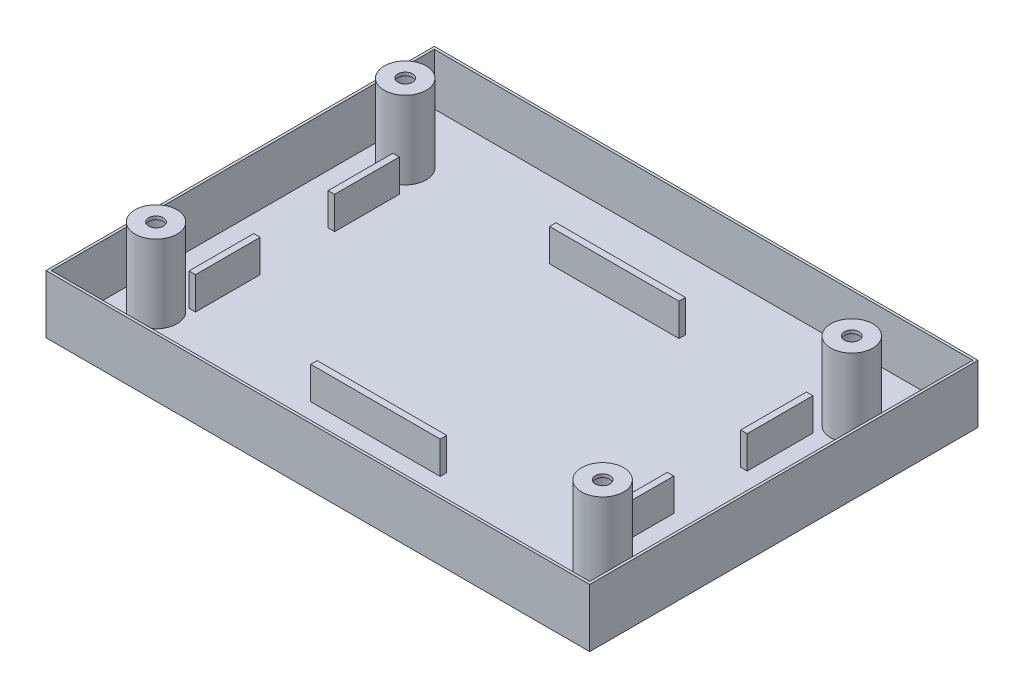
from build123d import *

# Parameters (mm, degrees)
SKETCH4_W             = 84
SKETCH4_H             = 60
BOSS_EXTRUDE2_DEPTH   = 9
SKETCH5_W             = 83.2
SKETCH5_H             = 59.2
CUT_EXTRUDE2_DEPTH    = 8
SKETCH9_W             = 1
SKETCH9_H             = 10
SKETCH9_H_2           = 10.159774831
SKETCH9_W_2           = 20
SKETCH9_H_3           = 1
BOSS_EXTRUDE4_DEPTH   = 5
SKETCH10_R            = 3.25
BOSS_EXTRUDE5_DEPTH   = 13
SKETCH11_R            = 2.9
CUT_EXTRUDE3_DEPTH    = 12.5
F_4_40_TAPPED_HOLE2_D = 2.2606
F_4_40_TAPPED_HOLE3_D = 2.2606


with BuildPart() as part:
    # Sketch4 → Boss-Extrude2 (new body)
    with BuildSketch(Plane(origin=(0, 0, 0), x_dir=(1, 0, 0), z_dir=(0, 1, 0))):
        with Locations((42, 30)):
            Rectangle(SKETCH4_W, SKETCH4_H)
    extrude(amount=BOSS_EXTRUDE2_DEPTH)

    # Sketch5 → Cut-Extrude2 (cut)
    with BuildSketch(Plane(origin=(0, 9, 0), x_dir=(1, 0, 0), z_dir=(0, 1, 0))):
        with Locations((42, 30)):
            Rectangle(SKETCH5_W, SKETCH5_H)
    extrude(amount=-CUT_EXTRUDE2_DEPTH, mode=Mode.SUBTRACT)

    # Sketch9 → Boss-Extrude4 (add)
    with BuildSketch(Plane(origin=(0, 1, 0), x_dir=(1, 0, 0), z_dir=(0, 1, 0))):
        with Locations((8.6, 40.5)):
            Rectangle(SKETCH9_W, SKETCH9_H)
        with Locations((8.6, 19)):
            Rectangle(SKETCH9_W, SKETCH9_H)
        with Locations((72.5, 40.420112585)):
            Rectangle(SKETCH9_W, SKETCH9_H_2)
        with Locations((72.5, 19)):
            Rectangle(SKETCH9_W, SKETCH9_H)
        with Locations((40, 48.3)):
            Rectangle(SKETCH9_W_2, SKETCH9_H_3)
        with Locations((40, 11.4)):
            Rectangle(SKETCH9_W_2, SKETCH9_H_3)
    extrude(amount=BOSS_EXTRUDE4_DEPTH)

    # Sketch10 → Boss-Extrude5 (add)
    with BuildSketch(Plane.XZ):
        with Locations(Location((6, -11, 0), (0, 0, 270))):
            Circle(SKETCH10_R)
        with Locations(Location((6, -49.5, 0), (0, 0, 270))):
            Circle(SKETCH10_R)
        with Locations(Location((75, -11, 0), (0, 0, 270))):
            Circle(SKETCH10_R)
        with Locations(Location((75, -49.5, 0), (0, 0, 270))):
            Circle(SKETCH10_R)
    extrude(amount=-BOSS_EXTRUDE5_DEPTH)

    # Sketch11 → Cut-Extrude3 (cut)
    with BuildSketch(Plane.XZ):
        with Locations(Location((6, -11, 0), (0, 0, 270))):
            Circle(SKETCH11_R)
        with Locations(Location((6, -49.5, 0), (0, 0, 270))):
            Circle(SKETCH11_R)
        with Locations(Location((75, -11, 0), (0, 0, 270))):
            Circle(SKETCH11_R)
        with Locations(Location((75, -49.5, 0), (0, 0, 270))):
            Circle(SKETCH11_R)
    extrude(amount=-CUT_EXTRUDE3_DEPTH, mode=Mode.SUBTRACT)

    # 4-40 Tapped Hole2 (through all)
    with Locations(Plane(origin=(6, 12.5, -49.5), x_dir=(0, 0, -1), z_dir=(0, -1, 0))):
        with Locations((0, 0)):
            Hole(F_4_40_TAPPED_HOLE2_D / 2)

    # 4-40 Tapped Hole3 (through all)
    with Locations(Plane(origin=(0, 12.5, 0), x_dir=(-1, 0, 0), z_dir=(0, -1, 0))):
        with Locations((-6, 11), (-75, 11), (-75, 49.5)):
            Hole(F_4_40_TAPPED_HOLE3_D / 2)


solid = part.part
